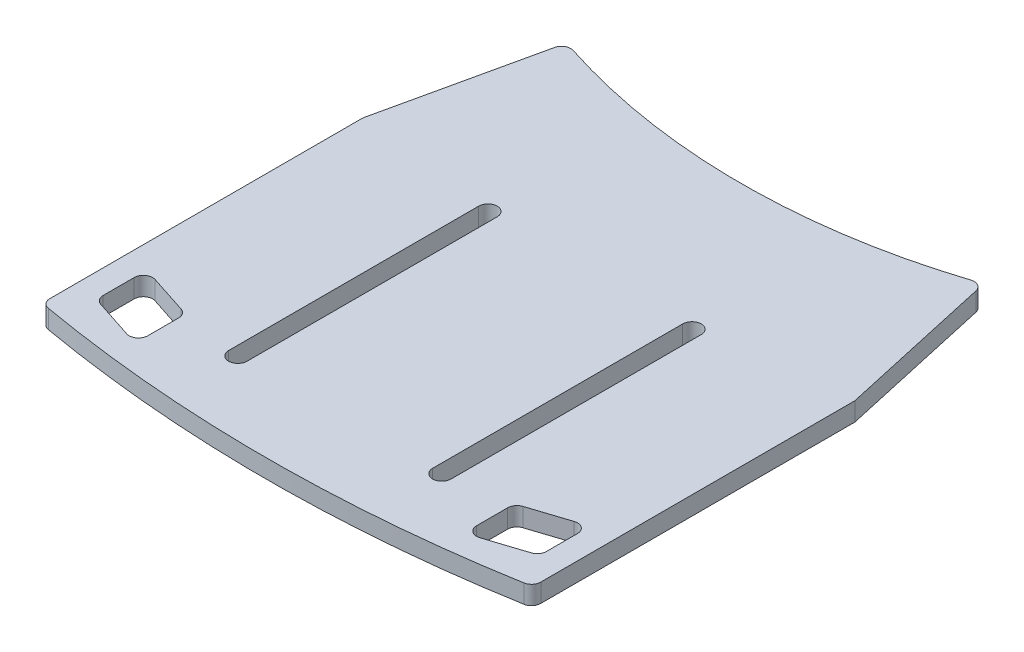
ISO-10303-21;
HEADER;
FILE_DESCRIPTION(('STEP AP214'),'2;1');
FILE_NAME('part.step','',(''),(''),'','','');
FILE_SCHEMA(('AUTOMOTIVE_DESIGN { 1 0 10303 214 1 1 1 1 }'));
ENDSEC;
DATA;
#1=APPLICATION_CONTEXT('core data for automotive mechanical design processes');
#2=APPLICATION_PROTOCOL_DEFINITION('international standard','automotive_design',2000,#1);
#3=PRODUCT_CONTEXT('',#1,'mechanical');
#4=PRODUCT('Part','Part','',(#3));
#5=PRODUCT_RELATED_PRODUCT_CATEGORY('part','',(#4));
#6=PRODUCT_DEFINITION_FORMATION('','',#4);
#7=PRODUCT_DEFINITION_CONTEXT('part definition',#1,'design');
#8=PRODUCT_DEFINITION('design','',#6,#7);
#9=PRODUCT_DEFINITION_SHAPE('','',#8);
#10=(LENGTH_UNIT() NAMED_UNIT(*) SI_UNIT(.MILLI.,.METRE.));
#11=(NAMED_UNIT(*) PLANE_ANGLE_UNIT() SI_UNIT($,.RADIAN.));
#12=(NAMED_UNIT(*) SI_UNIT($,.STERADIAN.) SOLID_ANGLE_UNIT());
#13=UNCERTAINTY_MEASURE_WITH_UNIT(LENGTH_MEASURE(1.E-05),#10,'distance_accuracy_value','');
#14=(GEOMETRIC_REPRESENTATION_CONTEXT(3) GLOBAL_UNCERTAINTY_ASSIGNED_CONTEXT((#13)) GLOBAL_UNIT_ASSIGNED_CONTEXT((#10,
#11,#12)) REPRESENTATION_CONTEXT('',''));
#15=CARTESIAN_POINT('',(0.,0.,0.));
#16=DIRECTION('',(0.,0.,1.));
#17=DIRECTION('',(1.,0.,0.));
#18=AXIS2_PLACEMENT_3D('',#15,#16,#17);
#19=CARTESIAN_POINT('',(0.0119064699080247,2.,-93.7813251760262));
#20=DIRECTION('',(0.,-1.,0.));
#21=DIRECTION('',(0.,0.,-1.));
#22=AXIS2_PLACEMENT_3D('',#19,#20,#21);
#23=PLANE('',#22);
#24=CARTESIAN_POINT('',(18.7664989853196,2.,22.4883956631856));
#25=DIRECTION('',(0.,1.,0.));
#26=DIRECTION('',(0.,0.,-1.));
#27=AXIS2_PLACEMENT_3D('',#24,#25,#26);
#28=CIRCLE('',#27,0.999999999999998);
#29=CARTESIAN_POINT('',(17.7664989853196,2.,22.4883956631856));
#30=VERTEX_POINT('',#29);
#31=CARTESIAN_POINT('',(19.076176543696,2.,23.4392372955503));
#32=VERTEX_POINT('',#31);
#33=EDGE_CURVE('E295',#30,#32,#28,.T.);
#34=ORIENTED_EDGE('',*,*,#33,.F.);
#35=DIRECTION('',(0.,0.,1.));
#36=VECTOR('',#35,1.);
#37=CARTESIAN_POINT('',(17.7664989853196,2.,22.4883956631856));
#38=LINE('',#37,#36);
#39=CARTESIAN_POINT('',(17.7664989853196,2.,19.13823337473));
#40=VERTEX_POINT('',#39);
#41=EDGE_CURVE('E311',#40,#30,#38,.T.);
#42=ORIENTED_EDGE('',*,*,#41,.F.);
#43=CARTESIAN_POINT('',(18.7664989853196,2.,19.13823337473));
#44=DIRECTION('',(0.,1.,0.));
#45=DIRECTION('',(0.,0.,-1.));
#46=AXIS2_PLACEMENT_3D('',#43,#44,#45);
#47=CIRCLE('',#46,0.999999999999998);
#48=CARTESIAN_POINT('',(18.4568214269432,2.,18.1873917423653));
#49=VERTEX_POINT('',#48);
#50=EDGE_CURVE('E308',#49,#40,#47,.T.);
#51=ORIENTED_EDGE('',*,*,#50,.F.);
#52=DIRECTION('',(-0.950841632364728,0.,0.309677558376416));
#53=VECTOR('',#52,1.);
#54=CARTESIAN_POINT('',(18.4568214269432,2.,18.1873917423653));
#55=LINE('',#54,#53);
#56=CARTESIAN_POINT('',(22.6354764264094,2.,16.8264546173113));
#57=VERTEX_POINT('',#56);
#58=EDGE_CURVE('E306',#57,#49,#55,.T.);
#59=ORIENTED_EDGE('',*,*,#58,.F.);
#60=CARTESIAN_POINT('',(22.9451539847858,2.,17.777296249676));
#61=DIRECTION('',(0.,1.,0.));
#62=DIRECTION('',(0.,0.,-1.));
#63=AXIS2_PLACEMENT_3D('',#60,#61,#62);
#64=CIRCLE('',#63,1.);
#65=CARTESIAN_POINT('',(23.9451539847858,2.,17.777296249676));
#66=VERTEX_POINT('',#65);
#67=EDGE_CURVE('E304',#66,#57,#64,.T.);
#68=ORIENTED_EDGE('',*,*,#67,.F.);
#69=DIRECTION('',(0.,0.,-1.));
#70=VECTOR('',#69,1.);
#71=CARTESIAN_POINT('',(23.9451539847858,2.,17.777296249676));
#72=LINE('',#71,#70);
#73=CARTESIAN_POINT('',(23.9451539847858,2.,21.1274585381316));
#74=VERTEX_POINT('',#73);
#75=EDGE_CURVE('E302',#74,#66,#72,.T.);
#76=ORIENTED_EDGE('',*,*,#75,.F.);
#77=CARTESIAN_POINT('',(22.9451539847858,2.,21.1274585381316));
#78=DIRECTION('',(0.,1.,0.));
#79=DIRECTION('',(0.,0.,1.));
#80=AXIS2_PLACEMENT_3D('',#77,#78,#79);
#81=CIRCLE('',#80,1.);
#82=CARTESIAN_POINT('',(23.2548315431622,2.,22.0783001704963));
#83=VERTEX_POINT('',#82);
#84=EDGE_CURVE('E300',#83,#74,#81,.T.);
#85=ORIENTED_EDGE('',*,*,#84,.F.);
#86=DIRECTION('',(0.950841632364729,0.,-0.309677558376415));
#87=VECTOR('',#86,1.);
#88=CARTESIAN_POINT('',(23.2548315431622,2.,22.0783001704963));
#89=LINE('',#88,#87);
#90=EDGE_CURVE('E297',#32,#83,#89,.T.);
#91=ORIENTED_EDGE('',*,*,#90,.F.);
#92=EDGE_LOOP('',(#34,#42,#51,#59,#68,#76,#85,#91));
#93=FACE_BOUND('',#92,.T.);
#94=CARTESIAN_POINT('',(-11.,2.,-7.50013879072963));
#95=DIRECTION('',(0.,1.,0.));
#96=DIRECTION('',(0.,0.,1.));
#97=AXIS2_PLACEMENT_3D('',#94,#95,#96);
#98=CIRCLE('',#97,0.999999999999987);
#99=CARTESIAN_POINT('',(-10.,2.,-7.50013879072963));
#100=VERTEX_POINT('',#99);
#101=CARTESIAN_POINT('',(-12.,2.,-7.50013879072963));
#102=VERTEX_POINT('',#101);
#103=EDGE_CURVE('E413',#100,#102,#98,.T.);
#104=ORIENTED_EDGE('',*,*,#103,.F.);
#105=DIRECTION('',(0.,0.,-1.));
#106=VECTOR('',#105,1.);
#107=CARTESIAN_POINT('',(-10.,2.,-7.50013879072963));
#108=LINE('',#107,#106);
#109=CARTESIAN_POINT('',(-10.,2.,19.4998612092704));
#110=VERTEX_POINT('',#109);
#111=EDGE_CURVE('E421',#110,#100,#108,.T.);
#112=ORIENTED_EDGE('',*,*,#111,.F.);
#113=CARTESIAN_POINT('',(-11.,2.,19.4998612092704));
#114=DIRECTION('',(0.,1.,0.));
#115=DIRECTION('',(0.,0.,1.));
#116=AXIS2_PLACEMENT_3D('',#113,#114,#115);
#117=CIRCLE('',#116,0.999999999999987);
#118=CARTESIAN_POINT('',(-12.,2.,19.4998612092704));
#119=VERTEX_POINT('',#118);
#120=EDGE_CURVE('E418',#119,#110,#117,.T.);
#121=ORIENTED_EDGE('',*,*,#120,.F.);
#122=DIRECTION('',(0.,0.,1.));
#123=VECTOR('',#122,1.);
#124=CARTESIAN_POINT('',(-12.,2.,-7.50013879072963));
#125=LINE('',#124,#123);
#126=EDGE_CURVE('E415',#102,#119,#125,.T.);
#127=ORIENTED_EDGE('',*,*,#126,.F.);
#128=EDGE_LOOP('',(#104,#112,#121,#127));
#129=FACE_BOUND('',#128,.T.);
#130=CARTESIAN_POINT('',(0.0119064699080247,2.,-93.7813251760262));
#131=DIRECTION('',(0.,-1.,0.));
#132=DIRECTION('',(0.,0.,-1.));
#133=AXIS2_PLACEMENT_3D('',#130,#131,#132);
#134=CIRCLE('',#133,70.);
#135=CARTESIAN_POINT('',(21.4809216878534,2.,-27.1548935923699));
#136=VERTEX_POINT('',#135);
#137=CARTESIAN_POINT('',(-21.4571087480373,2.,-27.1548935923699));
#138=VERTEX_POINT('',#137);
#139=EDGE_CURVE('E444',#136,#138,#134,.T.);
#140=ORIENTED_EDGE('',*,*,#139,.T.);
#141=CARTESIAN_POINT('',(-21.7638089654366,2.,-26.2030874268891));
#142=DIRECTION('',(0.,1.,0.));
#143=DIRECTION('',(0.,0.,-1.));
#144=AXIS2_PLACEMENT_3D('',#141,#142,#143);
#145=CIRCLE('',#144,1.00000000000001);
#146=CARTESIAN_POINT('',(-22.7399960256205,2.,-26.4200178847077));
#147=VERTEX_POINT('',#146);
#148=EDGE_CURVE('E446',#138,#147,#145,.T.);
#149=ORIENTED_EDGE('',*,*,#148,.T.);
#150=DIRECTION('',(-0.216930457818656,0.,0.976187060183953));
#151=VECTOR('',#150,1.);
#152=CARTESIAN_POINT('',(-22.7399960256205,2.,-26.4200178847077));
#153=LINE('',#152,#151);
#154=CARTESIAN_POINT('',(-26.4761870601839,2.,-9.60715822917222));
#155=VERTEX_POINT('',#154);
#156=EDGE_CURVE('E449',#147,#155,#153,.T.);
#157=ORIENTED_EDGE('',*,*,#156,.T.);
#158=CARTESIAN_POINT('',(-25.5,2.,-9.39022777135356));
#159=DIRECTION('',(0.,1.,0.));
#160=DIRECTION('',(0.,0.,1.));
#161=AXIS2_PLACEMENT_3D('',#158,#159,#160);
#162=CIRCLE('',#161,1.);
#163=CARTESIAN_POINT('',(-26.5,2.,-9.39022777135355));
#164=VERTEX_POINT('',#163);
#165=EDGE_CURVE('E451',#155,#164,#162,.T.);
#166=ORIENTED_EDGE('',*,*,#165,.T.);
#167=DIRECTION('',(0.,0.,1.));
#168=VECTOR('',#167,1.);
#169=CARTESIAN_POINT('',(-26.5,2.,-9.39022777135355));
#170=LINE('',#169,#168);
#171=CARTESIAN_POINT('',(-26.5,2.,24.2993138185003));
#172=VERTEX_POINT('',#171);
#173=EDGE_CURVE('E453',#164,#172,#170,.T.);
#174=ORIENTED_EDGE('',*,*,#173,.T.);
#175=CARTESIAN_POINT('',(-25.5,2.,24.2993138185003));
#176=DIRECTION('',(0.,1.,0.));
#177=DIRECTION('',(0.,0.,-1.));
#178=AXIS2_PLACEMENT_3D('',#175,#176,#177);
#179=CIRCLE('',#178,0.999999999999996);
#180=CARTESIAN_POINT('',(-25.6713268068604,2.,25.2845280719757));
#181=VERTEX_POINT('',#180);
#182=EDGE_CURVE('E455',#172,#181,#179,.T.);
#183=ORIENTED_EDGE('',*,*,#182,.T.);
#184=CARTESIAN_POINT('',(0.,2.,-122.338354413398));
#185=DIRECTION('',(0.,1.,0.));
#186=DIRECTION('',(0.,0.,1.));
#187=AXIS2_PLACEMENT_3D('',#184,#185,#186);
#188=CIRCLE('',#187,149.838354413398);
#189=CARTESIAN_POINT('',(25.6713268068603,2.,25.2845280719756));
#190=VERTEX_POINT('',#189);
#191=EDGE_CURVE('E457',#181,#190,#188,.T.);
#192=ORIENTED_EDGE('',*,*,#191,.T.);
#193=CARTESIAN_POINT('',(25.5,2.,24.2993138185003));
#194=DIRECTION('',(0.,1.,0.));
#195=DIRECTION('',(0.,0.,1.));
#196=AXIS2_PLACEMENT_3D('',#193,#194,#195);
#197=CIRCLE('',#196,1.);
#198=CARTESIAN_POINT('',(26.5,2.,24.2993138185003));
#199=VERTEX_POINT('',#198);
#200=EDGE_CURVE('E459',#190,#199,#197,.T.);
#201=ORIENTED_EDGE('',*,*,#200,.T.);
#202=DIRECTION('',(0.,0.,-1.));
#203=VECTOR('',#202,1.);
#204=CARTESIAN_POINT('',(26.5,2.,-9.60715822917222));
#205=LINE('',#204,#203);
#206=CARTESIAN_POINT('',(26.5,2.,-9.60715822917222));
#207=VERTEX_POINT('',#206);
#208=EDGE_CURVE('E461',#199,#207,#205,.T.);
#209=ORIENTED_EDGE('',*,*,#208,.T.);
#210=DIRECTION('',(-0.216930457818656,0.,-0.976187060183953));
#211=VECTOR('',#210,1.);
#212=CARTESIAN_POINT('',(22.7638089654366,2.,-26.4200178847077));
#213=LINE('',#212,#211);
#214=CARTESIAN_POINT('',(22.7638089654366,2.,-26.4200178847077));
#215=VERTEX_POINT('',#214);
#216=EDGE_CURVE('E463',#207,#215,#213,.T.);
#217=ORIENTED_EDGE('',*,*,#216,.T.);
#218=CARTESIAN_POINT('',(21.7876219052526,2.,-26.2030874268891));
#219=DIRECTION('',(0.,1.,0.));
#220=DIRECTION('',(0.,0.,1.));
#221=AXIS2_PLACEMENT_3D('',#218,#219,#220);
#222=CIRCLE('',#221,1.00000000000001);
#223=EDGE_CURVE('E465',#215,#136,#222,.T.);
#224=ORIENTED_EDGE('',*,*,#223,.T.);
#225=EDGE_LOOP('',(#140,#149,#157,#166,#174,#183,#192,#201,#209,#217,#224));
#226=FACE_BOUND('',#225,.T.);
#227=CARTESIAN_POINT('',(-18.7426860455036,2.,19.13823337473));
#228=DIRECTION('',(0.,1.,0.));
#229=DIRECTION('',(0.,0.,1.));
#230=AXIS2_PLACEMENT_3D('',#227,#228,#229);
#231=CIRCLE('',#230,0.999999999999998);
#232=CARTESIAN_POINT('',(-17.7426860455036,2.,19.13823337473));
#233=VERTEX_POINT('',#232);
#234=CARTESIAN_POINT('',(-18.4330084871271,2.,18.1873917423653));
#235=VERTEX_POINT('',#234);
#236=EDGE_CURVE('E354',#233,#235,#231,.T.);
#237=ORIENTED_EDGE('',*,*,#236,.F.);
#238=DIRECTION('',(0.,0.,-1.));
#239=VECTOR('',#238,1.);
#240=CARTESIAN_POINT('',(-17.7426860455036,2.,22.4883956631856));
#241=LINE('',#240,#239);
#242=CARTESIAN_POINT('',(-17.7426860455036,2.,22.4883956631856));
#243=VERTEX_POINT('',#242);
#244=EDGE_CURVE('E370',#243,#233,#241,.T.);
#245=ORIENTED_EDGE('',*,*,#244,.F.);
#246=CARTESIAN_POINT('',(-18.7426860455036,2.,22.4883956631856));
#247=DIRECTION('',(0.,1.,0.));
#248=DIRECTION('',(0.,0.,1.));
#249=AXIS2_PLACEMENT_3D('',#246,#247,#248);
#250=CIRCLE('',#249,0.999999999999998);
#251=CARTESIAN_POINT('',(-19.05236360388,2.,23.4392372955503));
#252=VERTEX_POINT('',#251);
#253=EDGE_CURVE('E367',#252,#243,#250,.T.);
#254=ORIENTED_EDGE('',*,*,#253,.F.);
#255=DIRECTION('',(0.950841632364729,0.,0.309677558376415));
#256=VECTOR('',#255,1.);
#257=CARTESIAN_POINT('',(-23.2310186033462,2.,22.0783001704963));
#258=LINE('',#257,#256);
#259=CARTESIAN_POINT('',(-23.2310186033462,2.,22.0783001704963));
#260=VERTEX_POINT('',#259);
#261=EDGE_CURVE('E365',#260,#252,#258,.T.);
#262=ORIENTED_EDGE('',*,*,#261,.F.);
#263=CARTESIAN_POINT('',(-22.9213410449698,2.,21.1274585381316));
#264=DIRECTION('',(0.,1.,0.));
#265=DIRECTION('',(0.,0.,-1.));
#266=AXIS2_PLACEMENT_3D('',#263,#264,#265);
#267=CIRCLE('',#266,1.);
#268=CARTESIAN_POINT('',(-23.9213410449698,2.,21.1274585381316));
#269=VERTEX_POINT('',#268);
#270=EDGE_CURVE('E363',#269,#260,#267,.T.);
#271=ORIENTED_EDGE('',*,*,#270,.F.);
#272=DIRECTION('',(0.,0.,1.));
#273=VECTOR('',#272,1.);
#274=CARTESIAN_POINT('',(-23.9213410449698,2.,17.777296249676));
#275=LINE('',#274,#273);
#276=CARTESIAN_POINT('',(-23.9213410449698,2.,17.777296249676));
#277=VERTEX_POINT('',#276);
#278=EDGE_CURVE('E361',#277,#269,#275,.T.);
#279=ORIENTED_EDGE('',*,*,#278,.F.);
#280=CARTESIAN_POINT('',(-22.9213410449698,2.,17.777296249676));
#281=DIRECTION('',(0.,1.,0.));
#282=DIRECTION('',(0.,0.,1.));
#283=AXIS2_PLACEMENT_3D('',#280,#281,#282);
#284=CIRCLE('',#283,1.);
#285=CARTESIAN_POINT('',(-22.6116634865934,2.,16.8264546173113));
#286=VERTEX_POINT('',#285);
#287=EDGE_CURVE('E359',#286,#277,#284,.T.);
#288=ORIENTED_EDGE('',*,*,#287,.F.);
#289=DIRECTION('',(-0.950841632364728,0.,-0.309677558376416));
#290=VECTOR('',#289,1.);
#291=CARTESIAN_POINT('',(-18.4330084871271,2.,18.1873917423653));
#292=LINE('',#291,#290);
#293=EDGE_CURVE('E356',#235,#286,#292,.T.);
#294=ORIENTED_EDGE('',*,*,#293,.F.);
#295=EDGE_LOOP('',(#237,#245,#254,#262,#271,#279,#288,#294));
#296=FACE_BOUND('',#295,.T.);
#297=CARTESIAN_POINT('',(11.0238129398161,2.,-7.50013879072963));
#298=DIRECTION('',(0.,1.,0.));
#299=DIRECTION('',(0.,0.,-1.));
#300=AXIS2_PLACEMENT_3D('',#297,#298,#299);
#301=CIRCLE('',#300,0.999999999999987);
#302=CARTESIAN_POINT('',(12.023812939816,2.,-7.50013879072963));
#303=VERTEX_POINT('',#302);
#304=CARTESIAN_POINT('',(10.0238129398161,2.,-7.50013879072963));
#305=VERTEX_POINT('',#304);
#306=EDGE_CURVE('E259',#303,#305,#301,.T.);
#307=ORIENTED_EDGE('',*,*,#306,.F.);
#308=DIRECTION('',(0.,0.,-1.));
#309=VECTOR('',#308,1.);
#310=CARTESIAN_POINT('',(12.023812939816,2.,-7.50013879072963));
#311=LINE('',#310,#309);
#312=CARTESIAN_POINT('',(12.023812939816,2.,19.4998612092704));
#313=VERTEX_POINT('',#312);
#314=EDGE_CURVE('E281',#313,#303,#311,.T.);
#315=ORIENTED_EDGE('',*,*,#314,.F.);
#316=CARTESIAN_POINT('',(11.0238129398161,2.,19.4998612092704));
#317=DIRECTION('',(0.,1.,0.));
#318=DIRECTION('',(0.,0.,-1.));
#319=AXIS2_PLACEMENT_3D('',#316,#317,#318);
#320=CIRCLE('',#319,0.999999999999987);
#321=CARTESIAN_POINT('',(10.0238129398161,2.,19.4998612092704));
#322=VERTEX_POINT('',#321);
#323=EDGE_CURVE('E279',#322,#313,#320,.T.);
#324=ORIENTED_EDGE('',*,*,#323,.F.);
#325=DIRECTION('',(0.,0.,1.));
#326=VECTOR('',#325,1.);
#327=CARTESIAN_POINT('',(10.0238129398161,2.,-7.50013879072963));
#328=LINE('',#327,#326);
#329=EDGE_CURVE('E267',#305,#322,#328,.T.);
#330=ORIENTED_EDGE('',*,*,#329,.F.);
#331=EDGE_LOOP('',(#307,#315,#324,#330));
#332=FACE_BOUND('',#331,.T.);
#333=ADVANCED_FACE('F32',(#93,#129,#226,#296,#332),#23,.F.);
#334=CARTESIAN_POINT('',(0.0119064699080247,0.,-93.7813251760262));
#335=DIRECTION('',(0.,-1.,0.));
#336=DIRECTION('',(0.,0.,-1.));
#337=AXIS2_PLACEMENT_3D('',#334,#335,#336);
#338=PLANE('',#337);
#339=DIRECTION('',(0.,0.,1.));
#340=VECTOR('',#339,1.);
#341=CARTESIAN_POINT('',(17.7664989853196,0.,22.4883956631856));
#342=LINE('',#341,#340);
#343=CARTESIAN_POINT('',(17.7664989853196,0.,19.13823337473));
#344=VERTEX_POINT('',#343);
#345=CARTESIAN_POINT('',(17.7664989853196,0.,22.4883956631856));
#346=VERTEX_POINT('',#345);
#347=EDGE_CURVE('E298',#344,#346,#342,.T.);
#348=ORIENTED_EDGE('',*,*,#347,.T.);
#349=CARTESIAN_POINT('',(18.7664989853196,0.,22.4883956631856));
#350=DIRECTION('',(0.,1.,0.));
#351=DIRECTION('',(0.,0.,-1.));
#352=AXIS2_PLACEMENT_3D('',#349,#350,#351);
#353=CIRCLE('',#352,0.999999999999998);
#354=CARTESIAN_POINT('',(19.076176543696,0.,23.4392372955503));
#355=VERTEX_POINT('',#354);
#356=EDGE_CURVE('E275',#346,#355,#353,.T.);
#357=ORIENTED_EDGE('',*,*,#356,.T.);
#358=DIRECTION('',(0.950841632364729,0.,-0.309677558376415));
#359=VECTOR('',#358,1.);
#360=CARTESIAN_POINT('',(23.2548315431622,0.,22.0783001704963));
#361=LINE('',#360,#359);
#362=CARTESIAN_POINT('',(23.2548315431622,0.,22.0783001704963));
#363=VERTEX_POINT('',#362);
#364=EDGE_CURVE('E316',#355,#363,#361,.T.);
#365=ORIENTED_EDGE('',*,*,#364,.T.);
#366=CARTESIAN_POINT('',(22.9451539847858,0.,21.1274585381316));
#367=DIRECTION('',(0.,1.,0.));
#368=DIRECTION('',(0.,0.,1.));
#369=AXIS2_PLACEMENT_3D('',#366,#367,#368);
#370=CIRCLE('',#369,1.);
#371=CARTESIAN_POINT('',(23.9451539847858,0.,21.1274585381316));
#372=VERTEX_POINT('',#371);
#373=EDGE_CURVE('E319',#363,#372,#370,.T.);
#374=ORIENTED_EDGE('',*,*,#373,.T.);
#375=DIRECTION('',(0.,0.,-1.));
#376=VECTOR('',#375,1.);
#377=CARTESIAN_POINT('',(23.9451539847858,0.,17.777296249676));
#378=LINE('',#377,#376);
#379=CARTESIAN_POINT('',(23.9451539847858,0.,17.777296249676));
#380=VERTEX_POINT('',#379);
#381=EDGE_CURVE('E322',#372,#380,#378,.T.);
#382=ORIENTED_EDGE('',*,*,#381,.T.);
#383=CARTESIAN_POINT('',(22.9451539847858,0.,17.777296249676));
#384=DIRECTION('',(0.,1.,0.));
#385=DIRECTION('',(0.,0.,-1.));
#386=AXIS2_PLACEMENT_3D('',#383,#384,#385);
#387=CIRCLE('',#386,1.);
#388=CARTESIAN_POINT('',(22.6354764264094,0.,16.8264546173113));
#389=VERTEX_POINT('',#388);
#390=EDGE_CURVE('E325',#380,#389,#387,.T.);
#391=ORIENTED_EDGE('',*,*,#390,.T.);
#392=DIRECTION('',(-0.950841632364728,0.,0.309677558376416));
#393=VECTOR('',#392,1.);
#394=CARTESIAN_POINT('',(18.4568214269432,0.,18.1873917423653));
#395=LINE('',#394,#393);
#396=CARTESIAN_POINT('',(18.4568214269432,0.,18.1873917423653));
#397=VERTEX_POINT('',#396);
#398=EDGE_CURVE('E328',#389,#397,#395,.T.);
#399=ORIENTED_EDGE('',*,*,#398,.T.);
#400=CARTESIAN_POINT('',(18.7664989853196,0.,19.13823337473));
#401=DIRECTION('',(0.,1.,0.));
#402=DIRECTION('',(0.,0.,-1.));
#403=AXIS2_PLACEMENT_3D('',#400,#401,#402);
#404=CIRCLE('',#403,0.999999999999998);
#405=EDGE_CURVE('E331',#397,#344,#404,.T.);
#406=ORIENTED_EDGE('',*,*,#405,.T.);
#407=EDGE_LOOP('',(#348,#357,#365,#374,#382,#391,#399,#406));
#408=FACE_BOUND('',#407,.T.);
#409=DIRECTION('',(0.,0.,-1.));
#410=VECTOR('',#409,1.);
#411=CARTESIAN_POINT('',(-10.,0.,-7.50013879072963));
#412=LINE('',#411,#410);
#413=CARTESIAN_POINT('',(-10.,0.,19.4998612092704));
#414=VERTEX_POINT('',#413);
#415=CARTESIAN_POINT('',(-10.,0.,-7.50013879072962));
#416=VERTEX_POINT('',#415);
#417=EDGE_CURVE('E416',#414,#416,#412,.T.);
#418=ORIENTED_EDGE('',*,*,#417,.T.);
#419=CARTESIAN_POINT('',(-11.,0.,-7.50013879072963));
#420=DIRECTION('',(0.,1.,0.));
#421=DIRECTION('',(0.,0.,1.));
#422=AXIS2_PLACEMENT_3D('',#419,#420,#421);
#423=CIRCLE('',#422,0.999999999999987);
#424=CARTESIAN_POINT('',(-12.,0.,-7.50013879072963));
#425=VERTEX_POINT('',#424);
#426=EDGE_CURVE('E412',#416,#425,#423,.T.);
#427=ORIENTED_EDGE('',*,*,#426,.T.);
#428=DIRECTION('',(0.,0.,1.));
#429=VECTOR('',#428,1.);
#430=CARTESIAN_POINT('',(-12.,0.,-7.50013879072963));
#431=LINE('',#430,#429);
#432=CARTESIAN_POINT('',(-12.,0.,19.4998612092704));
#433=VERTEX_POINT('',#432);
#434=EDGE_CURVE('E426',#425,#433,#431,.T.);
#435=ORIENTED_EDGE('',*,*,#434,.T.);
#436=CARTESIAN_POINT('',(-11.,0.,19.4998612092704));
#437=DIRECTION('',(0.,1.,0.));
#438=DIRECTION('',(0.,0.,1.));
#439=AXIS2_PLACEMENT_3D('',#436,#437,#438);
#440=CIRCLE('',#439,0.999999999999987);
#441=EDGE_CURVE('E429',#433,#414,#440,.T.);
#442=ORIENTED_EDGE('',*,*,#441,.T.);
#443=EDGE_LOOP('',(#418,#427,#435,#442));
#444=FACE_BOUND('',#443,.T.);
#445=CARTESIAN_POINT('',(0.0119064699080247,0.,-93.7813251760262));
#446=DIRECTION('',(0.,-1.,0.));
#447=DIRECTION('',(0.,0.,1.));
#448=AXIS2_PLACEMENT_3D('',#445,#446,#447);
#449=CIRCLE('',#448,70.);
#450=CARTESIAN_POINT('',(21.4809216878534,0.,-27.1548935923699));
#451=VERTEX_POINT('',#450);
#452=CARTESIAN_POINT('',(-21.4571087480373,0.,-27.1548935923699));
#453=VERTEX_POINT('',#452);
#454=EDGE_CURVE('E443',#451,#453,#449,.T.);
#455=ORIENTED_EDGE('',*,*,#454,.F.);
#456=CARTESIAN_POINT('',(21.7876219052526,0.,-26.2030874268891));
#457=DIRECTION('',(0.,1.,0.));
#458=DIRECTION('',(0.,0.,1.));
#459=AXIS2_PLACEMENT_3D('',#456,#457,#458);
#460=CIRCLE('',#459,1.00000000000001);
#461=CARTESIAN_POINT('',(22.7638089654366,0.,-26.4200178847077));
#462=VERTEX_POINT('',#461);
#463=EDGE_CURVE('E447',#462,#451,#460,.T.);
#464=ORIENTED_EDGE('',*,*,#463,.F.);
#465=DIRECTION('',(-0.216930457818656,0.,-0.976187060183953));
#466=VECTOR('',#465,1.);
#467=CARTESIAN_POINT('',(22.7638089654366,0.,-26.4200178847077));
#468=LINE('',#467,#466);
#469=CARTESIAN_POINT('',(26.5,0.,-9.60715822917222));
#470=VERTEX_POINT('',#469);
#471=EDGE_CURVE('E485',#470,#462,#468,.T.);
#472=ORIENTED_EDGE('',*,*,#471,.F.);
#473=DIRECTION('',(0.,0.,-1.));
#474=VECTOR('',#473,1.);
#475=CARTESIAN_POINT('',(26.5,0.,-9.60715822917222));
#476=LINE('',#475,#474);
#477=CARTESIAN_POINT('',(26.5,0.,24.2993138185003));
#478=VERTEX_POINT('',#477);
#479=EDGE_CURVE('E483',#478,#470,#476,.T.);
#480=ORIENTED_EDGE('',*,*,#479,.F.);
#481=CARTESIAN_POINT('',(25.5,0.,24.2993138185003));
#482=DIRECTION('',(0.,1.,0.));
#483=DIRECTION('',(0.,0.,1.));
#484=AXIS2_PLACEMENT_3D('',#481,#482,#483);
#485=CIRCLE('',#484,1.);
#486=CARTESIAN_POINT('',(25.6713268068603,0.,25.2845280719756));
#487=VERTEX_POINT('',#486);
#488=EDGE_CURVE('E481',#487,#478,#485,.T.);
#489=ORIENTED_EDGE('',*,*,#488,.F.);
#490=CARTESIAN_POINT('',(0.,0.,-122.338354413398));
#491=DIRECTION('',(0.,1.,0.));
#492=DIRECTION('',(0.,0.,1.));
#493=AXIS2_PLACEMENT_3D('',#490,#491,#492);
#494=CIRCLE('',#493,149.838354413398);
#495=CARTESIAN_POINT('',(-25.6713268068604,0.,25.2845280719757));
#496=VERTEX_POINT('',#495);
#497=EDGE_CURVE('E479',#496,#487,#494,.T.);
#498=ORIENTED_EDGE('',*,*,#497,.F.);
#499=CARTESIAN_POINT('',(-25.5,0.,24.2993138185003));
#500=DIRECTION('',(0.,1.,0.));
#501=DIRECTION('',(0.,0.,-1.));
#502=AXIS2_PLACEMENT_3D('',#499,#500,#501);
#503=CIRCLE('',#502,0.999999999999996);
#504=CARTESIAN_POINT('',(-26.5,0.,24.2993138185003));
#505=VERTEX_POINT('',#504);
#506=EDGE_CURVE('E477',#505,#496,#503,.T.);
#507=ORIENTED_EDGE('',*,*,#506,.F.);
#508=DIRECTION('',(0.,0.,1.));
#509=VECTOR('',#508,1.);
#510=CARTESIAN_POINT('',(-26.5,0.,-9.39022777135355));
#511=LINE('',#510,#509);
#512=CARTESIAN_POINT('',(-26.5,0.,-9.39022777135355));
#513=VERTEX_POINT('',#512);
#514=EDGE_CURVE('E475',#513,#505,#511,.T.);
#515=ORIENTED_EDGE('',*,*,#514,.F.);
#516=CARTESIAN_POINT('',(-25.5,0.,-9.39022777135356));
#517=DIRECTION('',(0.,1.,0.));
#518=DIRECTION('',(0.,0.,1.));
#519=AXIS2_PLACEMENT_3D('',#516,#517,#518);
#520=CIRCLE('',#519,1.);
#521=CARTESIAN_POINT('',(-26.4761870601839,0.,-9.60715822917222));
#522=VERTEX_POINT('',#521);
#523=EDGE_CURVE('E473',#522,#513,#520,.T.);
#524=ORIENTED_EDGE('',*,*,#523,.F.);
#525=DIRECTION('',(-0.216930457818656,0.,0.976187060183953));
#526=VECTOR('',#525,1.);
#527=CARTESIAN_POINT('',(-22.7399960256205,0.,-26.4200178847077));
#528=LINE('',#527,#526);
#529=CARTESIAN_POINT('',(-22.7399960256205,0.,-26.4200178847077));
#530=VERTEX_POINT('',#529);
#531=EDGE_CURVE('E471',#530,#522,#528,.T.);
#532=ORIENTED_EDGE('',*,*,#531,.F.);
#533=CARTESIAN_POINT('',(-21.7638089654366,0.,-26.2030874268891));
#534=DIRECTION('',(0.,1.,0.));
#535=DIRECTION('',(0.,0.,-1.));
#536=AXIS2_PLACEMENT_3D('',#533,#534,#535);
#537=CIRCLE('',#536,1.00000000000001);
#538=EDGE_CURVE('E469',#453,#530,#537,.T.);
#539=ORIENTED_EDGE('',*,*,#538,.F.);
#540=EDGE_LOOP('',(#455,#464,#472,#480,#489,#498,#507,#515,#524,#532,#539));
#541=FACE_BOUND('',#540,.T.);
#542=DIRECTION('',(0.,0.,-1.));
#543=VECTOR('',#542,1.);
#544=CARTESIAN_POINT('',(-17.7426860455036,0.,22.4883956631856));
#545=LINE('',#544,#543);
#546=CARTESIAN_POINT('',(-17.7426860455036,0.,22.4883956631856));
#547=VERTEX_POINT('',#546);
#548=CARTESIAN_POINT('',(-17.7426860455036,0.,19.13823337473));
#549=VERTEX_POINT('',#548);
#550=EDGE_CURVE('E357',#547,#549,#545,.T.);
#551=ORIENTED_EDGE('',*,*,#550,.T.);
#552=CARTESIAN_POINT('',(-18.7426860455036,0.,19.13823337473));
#553=DIRECTION('',(0.,1.,0.));
#554=DIRECTION('',(0.,0.,1.));
#555=AXIS2_PLACEMENT_3D('',#552,#553,#554);
#556=CIRCLE('',#555,0.999999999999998);
#557=CARTESIAN_POINT('',(-18.4330084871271,0.,18.1873917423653));
#558=VERTEX_POINT('',#557);
#559=EDGE_CURVE('E353',#549,#558,#556,.T.);
#560=ORIENTED_EDGE('',*,*,#559,.T.);
#561=DIRECTION('',(-0.950841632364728,0.,-0.309677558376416));
#562=VECTOR('',#561,1.);
#563=CARTESIAN_POINT('',(-18.4330084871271,0.,18.1873917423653));
#564=LINE('',#563,#562);
#565=CARTESIAN_POINT('',(-22.6116634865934,0.,16.8264546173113));
#566=VERTEX_POINT('',#565);
#567=EDGE_CURVE('E375',#558,#566,#564,.T.);
#568=ORIENTED_EDGE('',*,*,#567,.T.);
#569=CARTESIAN_POINT('',(-22.9213410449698,0.,17.777296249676));
#570=DIRECTION('',(0.,1.,0.));
#571=DIRECTION('',(0.,0.,1.));
#572=AXIS2_PLACEMENT_3D('',#569,#570,#571);
#573=CIRCLE('',#572,1.);
#574=CARTESIAN_POINT('',(-23.9213410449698,0.,17.777296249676));
#575=VERTEX_POINT('',#574);
#576=EDGE_CURVE('E378',#566,#575,#573,.T.);
#577=ORIENTED_EDGE('',*,*,#576,.T.);
#578=DIRECTION('',(0.,0.,1.));
#579=VECTOR('',#578,1.);
#580=CARTESIAN_POINT('',(-23.9213410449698,0.,17.777296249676));
#581=LINE('',#580,#579);
#582=CARTESIAN_POINT('',(-23.9213410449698,0.,21.1274585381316));
#583=VERTEX_POINT('',#582);
#584=EDGE_CURVE('E381',#575,#583,#581,.T.);
#585=ORIENTED_EDGE('',*,*,#584,.T.);
#586=CARTESIAN_POINT('',(-22.9213410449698,0.,21.1274585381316));
#587=DIRECTION('',(0.,1.,0.));
#588=DIRECTION('',(0.,0.,-1.));
#589=AXIS2_PLACEMENT_3D('',#586,#587,#588);
#590=CIRCLE('',#589,1.);
#591=CARTESIAN_POINT('',(-23.2310186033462,0.,22.0783001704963));
#592=VERTEX_POINT('',#591);
#593=EDGE_CURVE('E384',#583,#592,#590,.T.);
#594=ORIENTED_EDGE('',*,*,#593,.T.);
#595=DIRECTION('',(0.950841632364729,0.,0.309677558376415));
#596=VECTOR('',#595,1.);
#597=CARTESIAN_POINT('',(-23.2310186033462,0.,22.0783001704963));
#598=LINE('',#597,#596);
#599=CARTESIAN_POINT('',(-19.05236360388,0.,23.4392372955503));
#600=VERTEX_POINT('',#599);
#601=EDGE_CURVE('E387',#592,#600,#598,.T.);
#602=ORIENTED_EDGE('',*,*,#601,.T.);
#603=CARTESIAN_POINT('',(-18.7426860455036,0.,22.4883956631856));
#604=DIRECTION('',(0.,1.,0.));
#605=DIRECTION('',(0.,0.,1.));
#606=AXIS2_PLACEMENT_3D('',#603,#604,#605);
#607=CIRCLE('',#606,0.999999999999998);
#608=EDGE_CURVE('E390',#600,#547,#607,.T.);
#609=ORIENTED_EDGE('',*,*,#608,.T.);
#610=EDGE_LOOP('',(#551,#560,#568,#577,#585,#594,#602,#609));
#611=FACE_BOUND('',#610,.T.);
#612=DIRECTION('',(0.,0.,-1.));
#613=VECTOR('',#612,1.);
#614=CARTESIAN_POINT('',(12.023812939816,0.,-7.50013879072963));
#615=LINE('',#614,#613);
#616=CARTESIAN_POINT('',(12.023812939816,0.,19.4998612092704));
#617=VERTEX_POINT('',#616);
#618=CARTESIAN_POINT('',(12.023812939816,0.,-7.50013879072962));
#619=VERTEX_POINT('',#618);
#620=EDGE_CURVE('E268',#617,#619,#615,.T.);
#621=ORIENTED_EDGE('',*,*,#620,.T.);
#622=CARTESIAN_POINT('',(11.0238129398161,0.,-7.50013879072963));
#623=DIRECTION('',(0.,1.,0.));
#624=DIRECTION('',(0.,0.,-1.));
#625=AXIS2_PLACEMENT_3D('',#622,#623,#624);
#626=CIRCLE('',#625,0.999999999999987);
#627=CARTESIAN_POINT('',(10.0238129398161,0.,-7.50013879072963));
#628=VERTEX_POINT('',#627);
#629=EDGE_CURVE('E55',#619,#628,#626,.T.);
#630=ORIENTED_EDGE('',*,*,#629,.T.);
#631=DIRECTION('',(0.,0.,1.));
#632=VECTOR('',#631,1.);
#633=CARTESIAN_POINT('',(10.0238129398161,0.,-7.50013879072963));
#634=LINE('',#633,#632);
#635=CARTESIAN_POINT('',(10.0238129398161,0.,19.4998612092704));
#636=VERTEX_POINT('',#635);
#637=EDGE_CURVE('E274',#628,#636,#634,.T.);
#638=ORIENTED_EDGE('',*,*,#637,.T.);
#639=CARTESIAN_POINT('',(11.0238129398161,0.,19.4998612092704));
#640=DIRECTION('',(0.,1.,0.));
#641=DIRECTION('',(0.,0.,-1.));
#642=AXIS2_PLACEMENT_3D('',#639,#640,#641);
#643=CIRCLE('',#642,0.999999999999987);
#644=EDGE_CURVE('E287',#636,#617,#643,.T.);
#645=ORIENTED_EDGE('',*,*,#644,.T.);
#646=EDGE_LOOP('',(#621,#630,#638,#645));
#647=FACE_BOUND('',#646,.T.);
#648=ADVANCED_FACE('F526',(#408,#444,#541,#611,#647),#338,.T.);
#649=CARTESIAN_POINT('',(0.0119064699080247,2.,-93.7813251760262));
#650=DIRECTION('',(0.,-1.,0.));
#651=DIRECTION('',(0.,0.,-1.));
#652=AXIS2_PLACEMENT_3D('',#649,#650,#651);
#653=CYLINDRICAL_SURFACE('',#652,70.);
#654=ORIENTED_EDGE('',*,*,#454,.T.);
#655=DIRECTION('',(0.,-1.,0.));
#656=VECTOR('',#655,1.);
#657=CARTESIAN_POINT('',(-21.4571087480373,2.,-27.1548935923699));
#658=LINE('',#657,#656);
#659=EDGE_CURVE('E11',#138,#453,#658,.T.);
#660=ORIENTED_EDGE('',*,*,#659,.F.);
#661=ORIENTED_EDGE('',*,*,#139,.F.);
#662=DIRECTION('',(0.,-1.,0.));
#663=VECTOR('',#662,1.);
#664=CARTESIAN_POINT('',(21.4809216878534,2.,-27.1548935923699));
#665=LINE('',#664,#663);
#666=EDGE_CURVE('E467',#136,#451,#665,.T.);
#667=ORIENTED_EDGE('',*,*,#666,.T.);
#668=EDGE_LOOP('',(#654,#660,#661,#667));
#669=FACE_BOUND('',#668,.T.);
#670=ADVANCED_FACE('F34',(#669),#653,.F.);
#671=CARTESIAN_POINT('',(-21.7638089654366,2.,-26.2030874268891));
#672=DIRECTION('',(0.,-1.,0.));
#673=DIRECTION('',(0.,0.,-1.));
#674=AXIS2_PLACEMENT_3D('',#671,#672,#673);
#675=CYLINDRICAL_SURFACE('',#674,1.00000000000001);
#676=ORIENTED_EDGE('',*,*,#538,.T.);
#677=DIRECTION('',(0.,-1.,0.));
#678=VECTOR('',#677,1.);
#679=CARTESIAN_POINT('',(-22.7399960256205,2.,-26.4200178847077));
#680=LINE('',#679,#678);
#681=EDGE_CURVE('E40',#147,#530,#680,.T.);
#682=ORIENTED_EDGE('',*,*,#681,.F.);
#683=ORIENTED_EDGE('',*,*,#148,.F.);
#684=ORIENTED_EDGE('',*,*,#659,.T.);
#685=EDGE_LOOP('',(#676,#682,#683,#684));
#686=FACE_BOUND('',#685,.T.);
#687=ADVANCED_FACE('F544',(#686),#675,.T.);
#688=CARTESIAN_POINT('',(-22.7399960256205,2.,-26.4200178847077));
#689=DIRECTION('',(0.976187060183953,0.,0.216930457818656));
#690=DIRECTION('',(0.216930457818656,0.,-0.976187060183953));
#691=AXIS2_PLACEMENT_3D('',#688,#689,#690);
#692=PLANE('',#691);
#693=ORIENTED_EDGE('',*,*,#531,.T.);
#694=DIRECTION('',(0.,-1.,0.));
#695=VECTOR('',#694,1.);
#696=CARTESIAN_POINT('',(-26.4761870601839,2.,-9.60715822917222));
#697=LINE('',#696,#695);
#698=EDGE_CURVE('E512',#155,#522,#697,.T.);
#699=ORIENTED_EDGE('',*,*,#698,.F.);
#700=ORIENTED_EDGE('',*,*,#156,.F.);
#701=ORIENTED_EDGE('',*,*,#681,.T.);
#702=EDGE_LOOP('',(#693,#699,#700,#701));
#703=FACE_BOUND('',#702,.T.);
#704=ADVANCED_FACE('F519',(#703),#692,.F.);
#705=CARTESIAN_POINT('',(-25.5,2.,-9.39022777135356));
#706=DIRECTION('',(0.,-1.,0.));
#707=DIRECTION('',(0.,0.,-1.));
#708=AXIS2_PLACEMENT_3D('',#705,#706,#707);
#709=CYLINDRICAL_SURFACE('',#708,1.);
#710=ORIENTED_EDGE('',*,*,#523,.T.);
#711=DIRECTION('',(0.,-1.,0.));
#712=VECTOR('',#711,1.);
#713=CARTESIAN_POINT('',(-26.5,2.,-9.39022777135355));
#714=LINE('',#713,#712);
#715=EDGE_CURVE('E509',#164,#513,#714,.T.);
#716=ORIENTED_EDGE('',*,*,#715,.F.);
#717=ORIENTED_EDGE('',*,*,#165,.F.);
#718=ORIENTED_EDGE('',*,*,#698,.T.);
#719=EDGE_LOOP('',(#710,#716,#717,#718));
#720=FACE_BOUND('',#719,.T.);
#721=ADVANCED_FACE('F532',(#720),#709,.T.);
#722=CARTESIAN_POINT('',(-26.5,2.,-9.39022777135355));
#723=DIRECTION('',(1.,0.,0.));
#724=DIRECTION('',(0.,0.,-1.));
#725=AXIS2_PLACEMENT_3D('',#722,#723,#724);
#726=PLANE('',#725);
#727=ORIENTED_EDGE('',*,*,#514,.T.);
#728=DIRECTION('',(0.,-1.,0.));
#729=VECTOR('',#728,1.);
#730=CARTESIAN_POINT('',(-26.5,2.,24.2993138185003));
#731=LINE('',#730,#729);
#732=EDGE_CURVE('E506',#172,#505,#731,.T.);
#733=ORIENTED_EDGE('',*,*,#732,.F.);
#734=ORIENTED_EDGE('',*,*,#173,.F.);
#735=ORIENTED_EDGE('',*,*,#715,.T.);
#736=EDGE_LOOP('',(#727,#733,#734,#735));
#737=FACE_BOUND('',#736,.T.);
#738=ADVANCED_FACE('F536',(#737),#726,.F.);
#739=CARTESIAN_POINT('',(-25.5,2.,24.2993138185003));
#740=DIRECTION('',(0.,-1.,0.));
#741=DIRECTION('',(0.,0.,-1.));
#742=AXIS2_PLACEMENT_3D('',#739,#740,#741);
#743=CYLINDRICAL_SURFACE('',#742,0.999999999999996);
#744=ORIENTED_EDGE('',*,*,#506,.T.);
#745=DIRECTION('',(0.,-1.,0.));
#746=VECTOR('',#745,1.);
#747=CARTESIAN_POINT('',(-25.6713268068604,2.,25.2845280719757));
#748=LINE('',#747,#746);
#749=EDGE_CURVE('E503',#181,#496,#748,.T.);
#750=ORIENTED_EDGE('',*,*,#749,.F.);
#751=ORIENTED_EDGE('',*,*,#182,.F.);
#752=ORIENTED_EDGE('',*,*,#732,.T.);
#753=EDGE_LOOP('',(#744,#750,#751,#752));
#754=FACE_BOUND('',#753,.T.);
#755=ADVANCED_FACE('F572',(#754),#743,.T.);
#756=CARTESIAN_POINT('',(0.,2.,-122.338354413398));
#757=DIRECTION('',(0.,-1.,0.));
#758=DIRECTION('',(0.,0.,-1.));
#759=AXIS2_PLACEMENT_3D('',#756,#757,#758);
#760=CYLINDRICAL_SURFACE('',#759,149.838354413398);
#761=ORIENTED_EDGE('',*,*,#497,.T.);
#762=DIRECTION('',(0.,-1.,0.));
#763=VECTOR('',#762,1.);
#764=CARTESIAN_POINT('',(25.6713268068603,2.,25.2845280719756));
#765=LINE('',#764,#763);
#766=EDGE_CURVE('E500',#190,#487,#765,.T.);
#767=ORIENTED_EDGE('',*,*,#766,.F.);
#768=ORIENTED_EDGE('',*,*,#191,.F.);
#769=ORIENTED_EDGE('',*,*,#749,.T.);
#770=EDGE_LOOP('',(#761,#767,#768,#769));
#771=FACE_BOUND('',#770,.T.);
#772=ADVANCED_FACE('F570',(#771),#760,.T.);
#773=CARTESIAN_POINT('',(25.5,2.,24.2993138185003));
#774=DIRECTION('',(0.,-1.,0.));
#775=DIRECTION('',(0.,0.,-1.));
#776=AXIS2_PLACEMENT_3D('',#773,#774,#775);
#777=CYLINDRICAL_SURFACE('',#776,1.);
#778=ORIENTED_EDGE('',*,*,#488,.T.);
#779=DIRECTION('',(0.,-1.,0.));
#780=VECTOR('',#779,1.);
#781=CARTESIAN_POINT('',(26.5,2.,24.2993138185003));
#782=LINE('',#781,#780);
#783=EDGE_CURVE('E497',#199,#478,#782,.T.);
#784=ORIENTED_EDGE('',*,*,#783,.F.);
#785=ORIENTED_EDGE('',*,*,#200,.F.);
#786=ORIENTED_EDGE('',*,*,#766,.T.);
#787=EDGE_LOOP('',(#778,#784,#785,#786));
#788=FACE_BOUND('',#787,.T.);
#789=ADVANCED_FACE('F566',(#788),#777,.T.);
#790=CARTESIAN_POINT('',(26.5,2.,-9.60715822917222));
#791=DIRECTION('',(-1.,0.,0.));
#792=DIRECTION('',(0.,0.,1.));
#793=AXIS2_PLACEMENT_3D('',#790,#791,#792);
#794=PLANE('',#793);
#795=ORIENTED_EDGE('',*,*,#479,.T.);
#796=DIRECTION('',(0.,-1.,0.));
#797=VECTOR('',#796,1.);
#798=CARTESIAN_POINT('',(26.5,2.,-9.60715822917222));
#799=LINE('',#798,#797);
#800=EDGE_CURVE('E494',#207,#470,#799,.T.);
#801=ORIENTED_EDGE('',*,*,#800,.F.);
#802=ORIENTED_EDGE('',*,*,#208,.F.);
#803=ORIENTED_EDGE('',*,*,#783,.T.);
#804=EDGE_LOOP('',(#795,#801,#802,#803));
#805=FACE_BOUND('',#804,.T.);
#806=ADVANCED_FACE('F561',(#805),#794,.F.);
#807=CARTESIAN_POINT('',(22.7638089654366,2.,-26.4200178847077));
#808=DIRECTION('',(-0.976187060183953,0.,0.216930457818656));
#809=DIRECTION('',(0.216930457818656,0.,0.976187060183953));
#810=AXIS2_PLACEMENT_3D('',#807,#808,#809);
#811=PLANE('',#810);
#812=ORIENTED_EDGE('',*,*,#471,.T.);
#813=DIRECTION('',(0.,-1.,0.));
#814=VECTOR('',#813,1.);
#815=CARTESIAN_POINT('',(22.7638089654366,2.,-26.4200178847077));
#816=LINE('',#815,#814);
#817=EDGE_CURVE('E491',#215,#462,#816,.T.);
#818=ORIENTED_EDGE('',*,*,#817,.F.);
#819=ORIENTED_EDGE('',*,*,#216,.F.);
#820=ORIENTED_EDGE('',*,*,#800,.T.);
#821=EDGE_LOOP('',(#812,#818,#819,#820));
#822=FACE_BOUND('',#821,.T.);
#823=ADVANCED_FACE('F555',(#822),#811,.F.);
#824=CARTESIAN_POINT('',(21.7876219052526,2.,-26.2030874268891));
#825=DIRECTION('',(0.,-1.,0.));
#826=DIRECTION('',(0.,0.,-1.));
#827=AXIS2_PLACEMENT_3D('',#824,#825,#826);
#828=CYLINDRICAL_SURFACE('',#827,1.00000000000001);
#829=ORIENTED_EDGE('',*,*,#463,.T.);
#830=ORIENTED_EDGE('',*,*,#666,.F.);
#831=ORIENTED_EDGE('',*,*,#223,.F.);
#832=ORIENTED_EDGE('',*,*,#817,.T.);
#833=EDGE_LOOP('',(#829,#830,#831,#832));
#834=FACE_BOUND('',#833,.T.);
#835=ADVANCED_FACE('F550',(#834),#828,.T.);
#836=CARTESIAN_POINT('',(-11.,2.,-7.50013879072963));
#837=DIRECTION('',(0.,-1.,0.));
#838=DIRECTION('',(0.,0.,-1.));
#839=AXIS2_PLACEMENT_3D('',#836,#837,#838);
#840=CYLINDRICAL_SURFACE('',#839,0.999999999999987);
#841=ORIENTED_EDGE('',*,*,#426,.F.);
#842=DIRECTION('',(0.,-1.,0.));
#843=VECTOR('',#842,1.);
#844=CARTESIAN_POINT('',(-10.,2.,-7.50013879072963));
#845=LINE('',#844,#843);
#846=EDGE_CURVE('E423',#100,#416,#845,.T.);
#847=ORIENTED_EDGE('',*,*,#846,.F.);
#848=ORIENTED_EDGE('',*,*,#103,.T.);
#849=DIRECTION('',(0.,-1.,0.));
#850=VECTOR('',#849,1.);
#851=CARTESIAN_POINT('',(-12.,2.,-7.50013879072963));
#852=LINE('',#851,#850);
#853=EDGE_CURVE('E440',#102,#425,#852,.T.);
#854=ORIENTED_EDGE('',*,*,#853,.T.);
#855=EDGE_LOOP('',(#841,#847,#848,#854));
#856=FACE_BOUND('',#855,.T.);
#857=ADVANCED_FACE('F592',(#856),#840,.F.);
#858=CARTESIAN_POINT('',(-12.,2.,-7.50013879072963));
#859=DIRECTION('',(1.,0.,0.));
#860=DIRECTION('',(0.,0.,-1.));
#861=AXIS2_PLACEMENT_3D('',#858,#859,#860);
#862=PLANE('',#861);
#863=ORIENTED_EDGE('',*,*,#434,.F.);
#864=ORIENTED_EDGE('',*,*,#853,.F.);
#865=ORIENTED_EDGE('',*,*,#126,.T.);
#866=DIRECTION('',(0.,-1.,0.));
#867=VECTOR('',#866,1.);
#868=CARTESIAN_POINT('',(-12.,2.,19.4998612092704));
#869=LINE('',#868,#867);
#870=EDGE_CURVE('E438',#119,#433,#869,.T.);
#871=ORIENTED_EDGE('',*,*,#870,.T.);
#872=EDGE_LOOP('',(#863,#864,#865,#871));
#873=FACE_BOUND('',#872,.T.);
#874=ADVANCED_FACE('F624',(#873),#862,.T.);
#875=CARTESIAN_POINT('',(-11.,2.,19.4998612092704));
#876=DIRECTION('',(0.,-1.,0.));
#877=DIRECTION('',(0.,0.,-1.));
#878=AXIS2_PLACEMENT_3D('',#875,#876,#877);
#879=CYLINDRICAL_SURFACE('',#878,0.999999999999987);
#880=ORIENTED_EDGE('',*,*,#441,.F.);
#881=ORIENTED_EDGE('',*,*,#870,.F.);
#882=ORIENTED_EDGE('',*,*,#120,.T.);
#883=DIRECTION('',(0.,-1.,0.));
#884=VECTOR('',#883,1.);
#885=CARTESIAN_POINT('',(-10.,2.,19.4998612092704));
#886=LINE('',#885,#884);
#887=EDGE_CURVE('E436',#110,#414,#886,.T.);
#888=ORIENTED_EDGE('',*,*,#887,.T.);
#889=EDGE_LOOP('',(#880,#881,#882,#888));
#890=FACE_BOUND('',#889,.T.);
#891=ADVANCED_FACE('F631',(#890),#879,.F.);
#892=CARTESIAN_POINT('',(-10.,2.,-7.50013879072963));
#893=DIRECTION('',(-1.,0.,0.));
#894=DIRECTION('',(0.,0.,1.));
#895=AXIS2_PLACEMENT_3D('',#892,#893,#894);
#896=PLANE('',#895);
#897=ORIENTED_EDGE('',*,*,#417,.F.);
#898=ORIENTED_EDGE('',*,*,#887,.F.);
#899=ORIENTED_EDGE('',*,*,#111,.T.);
#900=ORIENTED_EDGE('',*,*,#846,.T.);
#901=EDGE_LOOP('',(#897,#898,#899,#900));
#902=FACE_BOUND('',#901,.T.);
#903=ADVANCED_FACE('F638',(#902),#896,.T.);
#904=CARTESIAN_POINT('',(-18.7426860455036,2.,19.13823337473));
#905=DIRECTION('',(0.,-1.,0.));
#906=DIRECTION('',(0.,0.,-1.));
#907=AXIS2_PLACEMENT_3D('',#904,#905,#906);
#908=CYLINDRICAL_SURFACE('',#907,0.999999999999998);
#909=ORIENTED_EDGE('',*,*,#559,.F.);
#910=DIRECTION('',(0.,-1.,0.));
#911=VECTOR('',#910,1.);
#912=CARTESIAN_POINT('',(-17.7426860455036,2.,19.13823337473));
#913=LINE('',#912,#911);
#914=EDGE_CURVE('E372',#233,#549,#913,.T.);
#915=ORIENTED_EDGE('',*,*,#914,.F.);
#916=ORIENTED_EDGE('',*,*,#236,.T.);
#917=DIRECTION('',(0.,-1.,0.));
#918=VECTOR('',#917,1.);
#919=CARTESIAN_POINT('',(-18.4330084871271,2.,18.1873917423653));
#920=LINE('',#919,#918);
#921=EDGE_CURVE('E409',#235,#558,#920,.T.);
#922=ORIENTED_EDGE('',*,*,#921,.T.);
#923=EDGE_LOOP('',(#909,#915,#916,#922));
#924=FACE_BOUND('',#923,.T.);
#925=ADVANCED_FACE('F646',(#924),#908,.F.);
#926=CARTESIAN_POINT('',(-18.4330084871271,2.,18.1873917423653));
#927=DIRECTION('',(-0.309677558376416,0.,0.950841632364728));
#928=DIRECTION('',(0.950841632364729,0.,0.309677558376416));
#929=AXIS2_PLACEMENT_3D('',#926,#927,#928);
#930=PLANE('',#929);
#931=ORIENTED_EDGE('',*,*,#567,.F.);
#932=ORIENTED_EDGE('',*,*,#921,.F.);
#933=ORIENTED_EDGE('',*,*,#293,.T.);
#934=DIRECTION('',(0.,-1.,0.));
#935=VECTOR('',#934,1.);
#936=CARTESIAN_POINT('',(-22.6116634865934,2.,16.8264546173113));
#937=LINE('',#936,#935);
#938=EDGE_CURVE('E407',#286,#566,#937,.T.);
#939=ORIENTED_EDGE('',*,*,#938,.T.);
#940=EDGE_LOOP('',(#931,#932,#933,#939));
#941=FACE_BOUND('',#940,.T.);
#942=ADVANCED_FACE('F654',(#941),#930,.T.);
#943=CARTESIAN_POINT('',(-22.9213410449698,2.,17.777296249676));
#944=DIRECTION('',(0.,-1.,0.));
#945=DIRECTION('',(0.,0.,-1.));
#946=AXIS2_PLACEMENT_3D('',#943,#944,#945);
#947=CYLINDRICAL_SURFACE('',#946,1.);
#948=ORIENTED_EDGE('',*,*,#576,.F.);
#949=ORIENTED_EDGE('',*,*,#938,.F.);
#950=ORIENTED_EDGE('',*,*,#287,.T.);
#951=DIRECTION('',(0.,-1.,0.));
#952=VECTOR('',#951,1.);
#953=CARTESIAN_POINT('',(-23.9213410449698,2.,17.777296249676));
#954=LINE('',#953,#952);
#955=EDGE_CURVE('E405',#277,#575,#954,.T.);
#956=ORIENTED_EDGE('',*,*,#955,.T.);
#957=EDGE_LOOP('',(#948,#949,#950,#956));
#958=FACE_BOUND('',#957,.T.);
#959=ADVANCED_FACE('F662',(#958),#947,.F.);
#960=CARTESIAN_POINT('',(-23.9213410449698,2.,17.777296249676));
#961=DIRECTION('',(1.,0.,0.));
#962=DIRECTION('',(0.,0.,-1.));
#963=AXIS2_PLACEMENT_3D('',#960,#961,#962);
#964=PLANE('',#963);
#965=ORIENTED_EDGE('',*,*,#584,.F.);
#966=ORIENTED_EDGE('',*,*,#955,.F.);
#967=ORIENTED_EDGE('',*,*,#278,.T.);
#968=DIRECTION('',(0.,-1.,0.));
#969=VECTOR('',#968,1.);
#970=CARTESIAN_POINT('',(-23.9213410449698,2.,21.1274585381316));
#971=LINE('',#970,#969);
#972=EDGE_CURVE('E403',#269,#583,#971,.T.);
#973=ORIENTED_EDGE('',*,*,#972,.T.);
#974=EDGE_LOOP('',(#965,#966,#967,#973));
#975=FACE_BOUND('',#974,.T.);
#976=ADVANCED_FACE('F670',(#975),#964,.T.);
#977=CARTESIAN_POINT('',(-22.9213410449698,2.,21.1274585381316));
#978=DIRECTION('',(0.,-1.,0.));
#979=DIRECTION('',(0.,0.,-1.));
#980=AXIS2_PLACEMENT_3D('',#977,#978,#979);
#981=CYLINDRICAL_SURFACE('',#980,1.);
#982=ORIENTED_EDGE('',*,*,#593,.F.);
#983=ORIENTED_EDGE('',*,*,#972,.F.);
#984=ORIENTED_EDGE('',*,*,#270,.T.);
#985=DIRECTION('',(0.,-1.,0.));
#986=VECTOR('',#985,1.);
#987=CARTESIAN_POINT('',(-23.2310186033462,2.,22.0783001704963));
#988=LINE('',#987,#986);
#989=EDGE_CURVE('E401',#260,#592,#988,.T.);
#990=ORIENTED_EDGE('',*,*,#989,.T.);
#991=EDGE_LOOP('',(#982,#983,#984,#990));
#992=FACE_BOUND('',#991,.T.);
#993=ADVANCED_FACE('F678',(#992),#981,.F.);
#994=CARTESIAN_POINT('',(-23.2310186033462,2.,22.0783001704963));
#995=DIRECTION('',(0.309677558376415,0.,-0.950841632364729));
#996=DIRECTION('',(-0.950841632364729,0.,-0.309677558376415));
#997=AXIS2_PLACEMENT_3D('',#994,#995,#996);
#998=PLANE('',#997);
#999=ORIENTED_EDGE('',*,*,#601,.F.);
#1000=ORIENTED_EDGE('',*,*,#989,.F.);
#1001=ORIENTED_EDGE('',*,*,#261,.T.);
#1002=DIRECTION('',(0.,-1.,0.));
#1003=VECTOR('',#1002,1.);
#1004=CARTESIAN_POINT('',(-19.05236360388,2.,23.4392372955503));
#1005=LINE('',#1004,#1003);
#1006=EDGE_CURVE('E399',#252,#600,#1005,.T.);
#1007=ORIENTED_EDGE('',*,*,#1006,.T.);
#1008=EDGE_LOOP('',(#999,#1000,#1001,#1007));
#1009=FACE_BOUND('',#1008,.T.);
#1010=ADVANCED_FACE('F686',(#1009),#998,.T.);
#1011=CARTESIAN_POINT('',(-18.7426860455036,2.,22.4883956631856));
#1012=DIRECTION('',(0.,-1.,0.));
#1013=DIRECTION('',(0.,0.,-1.));
#1014=AXIS2_PLACEMENT_3D('',#1011,#1012,#1013);
#1015=CYLINDRICAL_SURFACE('',#1014,0.999999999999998);
#1016=ORIENTED_EDGE('',*,*,#608,.F.);
#1017=ORIENTED_EDGE('',*,*,#1006,.F.);
#1018=ORIENTED_EDGE('',*,*,#253,.T.);
#1019=DIRECTION('',(0.,-1.,0.));
#1020=VECTOR('',#1019,1.);
#1021=CARTESIAN_POINT('',(-17.7426860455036,2.,22.4883956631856));
#1022=LINE('',#1021,#1020);
#1023=EDGE_CURVE('E397',#243,#547,#1022,.T.);
#1024=ORIENTED_EDGE('',*,*,#1023,.T.);
#1025=EDGE_LOOP('',(#1016,#1017,#1018,#1024));
#1026=FACE_BOUND('',#1025,.T.);
#1027=ADVANCED_FACE('F694',(#1026),#1015,.F.);
#1028=CARTESIAN_POINT('',(-17.7426860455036,2.,22.4883956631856));
#1029=DIRECTION('',(-1.,0.,0.));
#1030=DIRECTION('',(0.,0.,1.));
#1031=AXIS2_PLACEMENT_3D('',#1028,#1029,#1030);
#1032=PLANE('',#1031);
#1033=ORIENTED_EDGE('',*,*,#550,.F.);
#1034=ORIENTED_EDGE('',*,*,#1023,.F.);
#1035=ORIENTED_EDGE('',*,*,#244,.T.);
#1036=ORIENTED_EDGE('',*,*,#914,.T.);
#1037=EDGE_LOOP('',(#1033,#1034,#1035,#1036));
#1038=FACE_BOUND('',#1037,.T.);
#1039=ADVANCED_FACE('F702',(#1038),#1032,.T.);
#1040=CARTESIAN_POINT('',(18.7664989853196,2.,22.4883956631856));
#1041=DIRECTION('',(0.,-1.,0.));
#1042=DIRECTION('',(0.,0.,-1.));
#1043=AXIS2_PLACEMENT_3D('',#1040,#1041,#1042);
#1044=CYLINDRICAL_SURFACE('',#1043,0.999999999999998);
#1045=ORIENTED_EDGE('',*,*,#356,.F.);
#1046=DIRECTION('',(0.,-1.,0.));
#1047=VECTOR('',#1046,1.);
#1048=CARTESIAN_POINT('',(17.7664989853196,2.,22.4883956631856));
#1049=LINE('',#1048,#1047);
#1050=EDGE_CURVE('E313',#30,#346,#1049,.T.);
#1051=ORIENTED_EDGE('',*,*,#1050,.F.);
#1052=ORIENTED_EDGE('',*,*,#33,.T.);
#1053=DIRECTION('',(0.,-1.,0.));
#1054=VECTOR('',#1053,1.);
#1055=CARTESIAN_POINT('',(19.076176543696,2.,23.4392372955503));
#1056=LINE('',#1055,#1054);
#1057=EDGE_CURVE('E350',#32,#355,#1056,.T.);
#1058=ORIENTED_EDGE('',*,*,#1057,.T.);
#1059=EDGE_LOOP('',(#1045,#1051,#1052,#1058));
#1060=FACE_BOUND('',#1059,.T.);
#1061=ADVANCED_FACE('F710',(#1060),#1044,.F.);
#1062=CARTESIAN_POINT('',(23.2548315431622,2.,22.0783001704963));
#1063=DIRECTION('',(-0.309677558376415,0.,-0.950841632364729));
#1064=DIRECTION('',(-0.950841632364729,0.,0.309677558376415));
#1065=AXIS2_PLACEMENT_3D('',#1062,#1063,#1064);
#1066=PLANE('',#1065);
#1067=ORIENTED_EDGE('',*,*,#364,.F.);
#1068=ORIENTED_EDGE('',*,*,#1057,.F.);
#1069=ORIENTED_EDGE('',*,*,#90,.T.);
#1070=DIRECTION('',(0.,-1.,0.));
#1071=VECTOR('',#1070,1.);
#1072=CARTESIAN_POINT('',(23.2548315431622,2.,22.0783001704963));
#1073=LINE('',#1072,#1071);
#1074=EDGE_CURVE('E348',#83,#363,#1073,.T.);
#1075=ORIENTED_EDGE('',*,*,#1074,.T.);
#1076=EDGE_LOOP('',(#1067,#1068,#1069,#1075));
#1077=FACE_BOUND('',#1076,.T.);
#1078=ADVANCED_FACE('F718',(#1077),#1066,.T.);
#1079=CARTESIAN_POINT('',(22.9451539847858,2.,21.1274585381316));
#1080=DIRECTION('',(0.,-1.,0.));
#1081=DIRECTION('',(0.,0.,-1.));
#1082=AXIS2_PLACEMENT_3D('',#1079,#1080,#1081);
#1083=CYLINDRICAL_SURFACE('',#1082,1.);
#1084=ORIENTED_EDGE('',*,*,#373,.F.);
#1085=ORIENTED_EDGE('',*,*,#1074,.F.);
#1086=ORIENTED_EDGE('',*,*,#84,.T.);
#1087=DIRECTION('',(0.,-1.,0.));
#1088=VECTOR('',#1087,1.);
#1089=CARTESIAN_POINT('',(23.9451539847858,2.,21.1274585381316));
#1090=LINE('',#1089,#1088);
#1091=EDGE_CURVE('E346',#74,#372,#1090,.T.);
#1092=ORIENTED_EDGE('',*,*,#1091,.T.);
#1093=EDGE_LOOP('',(#1084,#1085,#1086,#1092));
#1094=FACE_BOUND('',#1093,.T.);
#1095=ADVANCED_FACE('F726',(#1094),#1083,.F.);
#1096=CARTESIAN_POINT('',(23.9451539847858,2.,17.777296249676));
#1097=DIRECTION('',(-1.,0.,0.));
#1098=DIRECTION('',(0.,0.,1.));
#1099=AXIS2_PLACEMENT_3D('',#1096,#1097,#1098);
#1100=PLANE('',#1099);
#1101=ORIENTED_EDGE('',*,*,#381,.F.);
#1102=ORIENTED_EDGE('',*,*,#1091,.F.);
#1103=ORIENTED_EDGE('',*,*,#75,.T.);
#1104=DIRECTION('',(0.,-1.,0.));
#1105=VECTOR('',#1104,1.);
#1106=CARTESIAN_POINT('',(23.9451539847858,2.,17.777296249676));
#1107=LINE('',#1106,#1105);
#1108=EDGE_CURVE('E344',#66,#380,#1107,.T.);
#1109=ORIENTED_EDGE('',*,*,#1108,.T.);
#1110=EDGE_LOOP('',(#1101,#1102,#1103,#1109));
#1111=FACE_BOUND('',#1110,.T.);
#1112=ADVANCED_FACE('F734',(#1111),#1100,.T.);
#1113=CARTESIAN_POINT('',(22.9451539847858,2.,17.777296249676));
#1114=DIRECTION('',(0.,-1.,0.));
#1115=DIRECTION('',(0.,0.,-1.));
#1116=AXIS2_PLACEMENT_3D('',#1113,#1114,#1115);
#1117=CYLINDRICAL_SURFACE('',#1116,1.);
#1118=ORIENTED_EDGE('',*,*,#390,.F.);
#1119=ORIENTED_EDGE('',*,*,#1108,.F.);
#1120=ORIENTED_EDGE('',*,*,#67,.T.);
#1121=DIRECTION('',(0.,-1.,0.));
#1122=VECTOR('',#1121,1.);
#1123=CARTESIAN_POINT('',(22.6354764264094,2.,16.8264546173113));
#1124=LINE('',#1123,#1122);
#1125=EDGE_CURVE('E342',#57,#389,#1124,.T.);
#1126=ORIENTED_EDGE('',*,*,#1125,.T.);
#1127=EDGE_LOOP('',(#1118,#1119,#1120,#1126));
#1128=FACE_BOUND('',#1127,.T.);
#1129=ADVANCED_FACE('F742',(#1128),#1117,.F.);
#1130=CARTESIAN_POINT('',(18.4568214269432,2.,18.1873917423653));
#1131=DIRECTION('',(0.309677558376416,0.,0.950841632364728));
#1132=DIRECTION('',(0.950841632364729,0.,-0.309677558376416));
#1133=AXIS2_PLACEMENT_3D('',#1130,#1131,#1132);
#1134=PLANE('',#1133);
#1135=ORIENTED_EDGE('',*,*,#398,.F.);
#1136=ORIENTED_EDGE('',*,*,#1125,.F.);
#1137=ORIENTED_EDGE('',*,*,#58,.T.);
#1138=DIRECTION('',(0.,-1.,0.));
#1139=VECTOR('',#1138,1.);
#1140=CARTESIAN_POINT('',(18.4568214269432,2.,18.1873917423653));
#1141=LINE('',#1140,#1139);
#1142=EDGE_CURVE('E340',#49,#397,#1141,.T.);
#1143=ORIENTED_EDGE('',*,*,#1142,.T.);
#1144=EDGE_LOOP('',(#1135,#1136,#1137,#1143));
#1145=FACE_BOUND('',#1144,.T.);
#1146=ADVANCED_FACE('F750',(#1145),#1134,.T.);
#1147=CARTESIAN_POINT('',(18.7664989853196,2.,19.13823337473));
#1148=DIRECTION('',(0.,-1.,0.));
#1149=DIRECTION('',(0.,0.,-1.));
#1150=AXIS2_PLACEMENT_3D('',#1147,#1148,#1149);
#1151=CYLINDRICAL_SURFACE('',#1150,0.999999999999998);
#1152=ORIENTED_EDGE('',*,*,#405,.F.);
#1153=ORIENTED_EDGE('',*,*,#1142,.F.);
#1154=ORIENTED_EDGE('',*,*,#50,.T.);
#1155=DIRECTION('',(0.,-1.,0.));
#1156=VECTOR('',#1155,1.);
#1157=CARTESIAN_POINT('',(17.7664989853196,2.,19.13823337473));
#1158=LINE('',#1157,#1156);
#1159=EDGE_CURVE('E338',#40,#344,#1158,.T.);
#1160=ORIENTED_EDGE('',*,*,#1159,.T.);
#1161=EDGE_LOOP('',(#1152,#1153,#1154,#1160));
#1162=FACE_BOUND('',#1161,.T.);
#1163=ADVANCED_FACE('F758',(#1162),#1151,.F.);
#1164=CARTESIAN_POINT('',(17.7664989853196,2.,22.4883956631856));
#1165=DIRECTION('',(1.,0.,0.));
#1166=DIRECTION('',(0.,0.,-1.));
#1167=AXIS2_PLACEMENT_3D('',#1164,#1165,#1166);
#1168=PLANE('',#1167);
#1169=ORIENTED_EDGE('',*,*,#347,.F.);
#1170=ORIENTED_EDGE('',*,*,#1159,.F.);
#1171=ORIENTED_EDGE('',*,*,#41,.T.);
#1172=ORIENTED_EDGE('',*,*,#1050,.T.);
#1173=EDGE_LOOP('',(#1169,#1170,#1171,#1172));
#1174=FACE_BOUND('',#1173,.T.);
#1175=ADVANCED_FACE('F766',(#1174),#1168,.T.);
#1176=CARTESIAN_POINT('',(11.0238129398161,2.,-7.50013879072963));
#1177=DIRECTION('',(0.,-1.,0.));
#1178=DIRECTION('',(0.,0.,-1.));
#1179=AXIS2_PLACEMENT_3D('',#1176,#1177,#1178);
#1180=CYLINDRICAL_SURFACE('',#1179,0.999999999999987);
#1181=ORIENTED_EDGE('',*,*,#629,.F.);
#1182=DIRECTION('',(0.,-1.,0.));
#1183=VECTOR('',#1182,1.);
#1184=CARTESIAN_POINT('',(12.023812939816,2.,-7.50013879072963));
#1185=LINE('',#1184,#1183);
#1186=EDGE_CURVE('E263',#303,#619,#1185,.T.);
#1187=ORIENTED_EDGE('',*,*,#1186,.F.);
#1188=ORIENTED_EDGE('',*,*,#306,.T.);
#1189=DIRECTION('',(0.,-1.,0.));
#1190=VECTOR('',#1189,1.);
#1191=CARTESIAN_POINT('',(10.0238129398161,2.,-7.50013879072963));
#1192=LINE('',#1191,#1190);
#1193=EDGE_CURVE('E262',#305,#628,#1192,.T.);
#1194=ORIENTED_EDGE('',*,*,#1193,.T.);
#1195=EDGE_LOOP('',(#1181,#1187,#1188,#1194));
#1196=FACE_BOUND('',#1195,.T.);
#1197=ADVANCED_FACE('F261',(#1196),#1180,.F.);
#1198=CARTESIAN_POINT('',(10.0238129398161,2.,-7.50013879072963));
#1199=DIRECTION('',(1.,0.,0.));
#1200=DIRECTION('',(0.,0.,-1.));
#1201=AXIS2_PLACEMENT_3D('',#1198,#1199,#1200);
#1202=PLANE('',#1201);
#1203=ORIENTED_EDGE('',*,*,#637,.F.);
#1204=ORIENTED_EDGE('',*,*,#1193,.F.);
#1205=ORIENTED_EDGE('',*,*,#329,.T.);
#1206=DIRECTION('',(0.,-1.,0.));
#1207=VECTOR('',#1206,1.);
#1208=CARTESIAN_POINT('',(10.0238129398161,2.,19.4998612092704));
#1209=LINE('',#1208,#1207);
#1210=EDGE_CURVE('E276',#322,#636,#1209,.T.);
#1211=ORIENTED_EDGE('',*,*,#1210,.T.);
#1212=EDGE_LOOP('',(#1203,#1204,#1205,#1211));
#1213=FACE_BOUND('',#1212,.T.);
#1214=ADVANCED_FACE('F271',(#1213),#1202,.T.);
#1215=CARTESIAN_POINT('',(11.0238129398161,2.,19.4998612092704));
#1216=DIRECTION('',(0.,-1.,0.));
#1217=DIRECTION('',(0.,0.,-1.));
#1218=AXIS2_PLACEMENT_3D('',#1215,#1216,#1217);
#1219=CYLINDRICAL_SURFACE('',#1218,0.999999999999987);
#1220=ORIENTED_EDGE('',*,*,#644,.F.);
#1221=ORIENTED_EDGE('',*,*,#1210,.F.);
#1222=ORIENTED_EDGE('',*,*,#323,.T.);
#1223=DIRECTION('',(0.,-1.,0.));
#1224=VECTOR('',#1223,1.);
#1225=CARTESIAN_POINT('',(12.023812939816,2.,19.4998612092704));
#1226=LINE('',#1225,#1224);
#1227=EDGE_CURVE('E47',#313,#617,#1226,.T.);
#1228=ORIENTED_EDGE('',*,*,#1227,.T.);
#1229=EDGE_LOOP('',(#1220,#1221,#1222,#1228));
#1230=FACE_BOUND('',#1229,.T.);
#1231=ADVANCED_FACE('F787',(#1230),#1219,.F.);
#1232=CARTESIAN_POINT('',(12.023812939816,2.,-7.50013879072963));
#1233=DIRECTION('',(-1.,0.,0.));
#1234=DIRECTION('',(0.,0.,1.));
#1235=AXIS2_PLACEMENT_3D('',#1232,#1233,#1234);
#1236=PLANE('',#1235);
#1237=ORIENTED_EDGE('',*,*,#620,.F.);
#1238=ORIENTED_EDGE('',*,*,#1227,.F.);
#1239=ORIENTED_EDGE('',*,*,#314,.T.);
#1240=ORIENTED_EDGE('',*,*,#1186,.T.);
#1241=EDGE_LOOP('',(#1237,#1238,#1239,#1240));
#1242=FACE_BOUND('',#1241,.T.);
#1243=ADVANCED_FACE('F794',(#1242),#1236,.T.);
#1244=CLOSED_SHELL('',(#333,#648,#670,#687,#704,#721,#738,#755,#772,#789,#806,#823,#835,#857,
#874,#891,#903,#925,#942,#959,#976,#993,#1010,#1027,#1039,#1061,#1078,#1095,#1112,#1129,#1146,
#1163,#1175,#1197,#1214,#1231,#1243));
#1245=MANIFOLD_SOLID_BREP('B2',#1244);
#1246=ADVANCED_BREP_SHAPE_REPRESENTATION('',(#18,#1245),#14);
#1247=SHAPE_DEFINITION_REPRESENTATION(#9,#1246);
ENDSEC;
END-ISO-10303-21;
